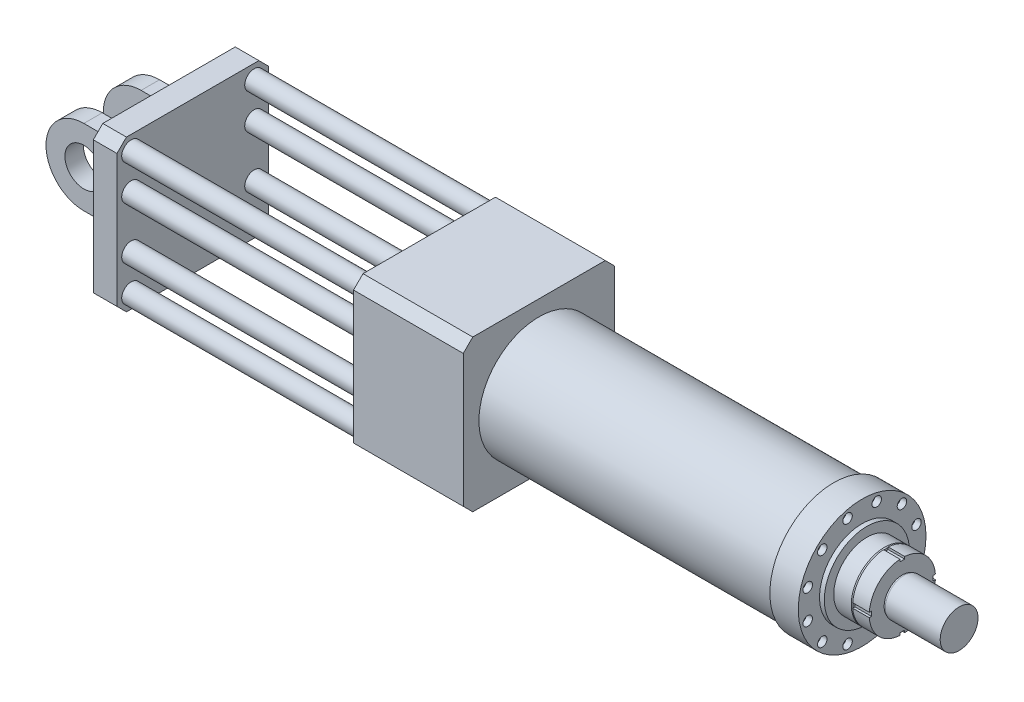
from build123d import *

# Parameters (mm, degrees)
SKETCH_1_R                = 127
SKETCH_1_R_2              = 110
EXTRUDE_1_DEPTH           = 623
SKETCH_2_R                = 135
SKETCH_2_R_2              = 6.5
EXTRUDE_2_DEPTH           = 60
SKETCH_3_R                = 90
EXTRUDE_3_DEPTH           = 10
SKETCH_5_R                = 70
EXTRUDE_4_DEPTH           = 40
CHAMFER_1_SIZE            = 3
CHAMFER_1_SIZE2           = 1.091910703
SKETCH_7_R                = 70
EXTRUDE_5_DEPTH           = 35
SKETCH_8_R                = 38.5
EXTRUDE_6_DEPTH           = 4
SKETCH_9_R                = 40
EXTRUDE_7_DEPTH           = 116
SKETCH_10_W               = 10
SKETCH_10_H               = 12.219318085
SKETCH_10_W_2             = 33.965202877
SKETCH_10_H_2             = 10
SKETCH_10_H_3             = 35.687535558
CUT_EXTRUDE_2_DEPTH       = 35
SKETCH_11_R               = 130
EXTRUDE_8_DEPTH           = 162
SKETCH_15_W               = 320
SKETCH_15_H               = 320
EXTRUDE_10_DEPTH          = 70
SKETCH_16_R               = 80
CUT_EXTRUDE_4_DEPTH       = 26
SKETCH_17_R               = 81.5
CUT_EXTRUDE_5_DEPTH       = 38
EXTRUDE_START             = 500
SKETCH_18_W               = 320
SKETCH_18_H               = 320
EXTRUDE_11_DEPTH          = 50
SKETCH_19_R               = 20
EXTRUDE_12_DEPTH          = 500
SKETCH_22_W               = 10
SKETCH_22_H               = 13
HOLE_WIZARD_1_AT_2_COUNT  = 2
HOLE_WIZARD_1_AT_2_PITCH  = 61.598932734
HOLE_WIZARD_1_AT_3_COUNT  = 2
HOLE_WIZARD_1_AT_3_PITCH  = 119
HOLE_WIZARD_1_AT_4_COUNT  = 2
HOLE_WIZARD_1_AT_4_PITCH  = 168.291413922
HOLE_WIZARD_1_AT_5_COUNT  = 2
HOLE_WIZARD_1_AT_5_PITCH  = 206.114046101
HOLE_WIZARD_1_AT_6_COUNT  = 2
HOLE_WIZARD_1_AT_6_PITCH  = 229.890346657
HOLE_WIZARD_1_AT_7_COUNT  = 2
HOLE_WIZARD_1_AT_7_PITCH  = 238
HOLE_WIZARD_1_AT_8_COUNT  = 2
HOLE_WIZARD_1_AT_8_PITCH  = 229.890346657
HOLE_WIZARD_1_AT_9_COUNT  = 2
HOLE_WIZARD_1_AT_9_PITCH  = 206.114046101
HOLE_WIZARD_1_AT_10_COUNT = 2
HOLE_WIZARD_1_AT_10_PITCH = 168.291413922
HOLE_WIZARD_1_AT_11_COUNT = 2
HOLE_WIZARD_1_AT_11_PITCH = 119
HOLE_WIZARD_1_AT_12_COUNT = 2
HOLE_WIZARD_1_AT_12_PITCH = 61.598932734
SKETCH_23_W               = 39
SKETCH_23_H               = 160
EXTRUDE_13_DEPTH          = 180
SKETCH_24_R               = 40
CUT_EXTRUDE_6_DEPTH       = 180
CHAMFER_2_SIZE            = 20
CHAMFER_3_SIZE            = 10
CHAMFER_4_SIZE            = 20
EXTRUDE_14_DEPTH          = 162


with BuildPart() as part:
    # Sketch 1 → Extrude 1 (new body)
    with BuildSketch(Plane(origin=(0, 0, 0), x_dir=(0, 0, -1), z_dir=(1, 0, 0))):
        Circle(SKETCH_1_R)
        Circle(SKETCH_1_R_2, mode=Mode.SUBTRACT)
    extrude(amount=EXTRUDE_1_DEPTH)



with BuildPart() as body_2:
    # Sketch 2 → Extrude 2 (new body)
    with BuildSketch(Plane(origin=(623, 0, 0), x_dir=(0, 0, -1), z_dir=(1, 0, 0))):
        Circle(SKETCH_2_R)
        with Locations((30.799466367, 114.945173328)):
            Circle(SKETCH_2_R_2, mode=Mode.SUBTRACT)
        with Locations((84.145706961, 84.145706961)):
            Circle(SKETCH_2_R_2, mode=Mode.SUBTRACT)
        with Locations((114.945173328, 30.799466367)):
            Circle(SKETCH_2_R_2, mode=Mode.SUBTRACT)
        with Locations((114.945173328, -30.799466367)):
            Circle(SKETCH_2_R_2, mode=Mode.SUBTRACT)
        with Locations((84.145706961, -84.145706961)):
            Circle(SKETCH_2_R_2, mode=Mode.SUBTRACT)
        with Locations((30.799466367, -114.945173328)):
            Circle(SKETCH_2_R_2, mode=Mode.SUBTRACT)
        with Locations((-30.799466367, -114.945173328)):
            Circle(SKETCH_2_R_2, mode=Mode.SUBTRACT)
        with Locations((-84.145706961, -84.145706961)):
            Circle(SKETCH_2_R_2, mode=Mode.SUBTRACT)
        with Locations((-114.945173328, -30.799466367)):
            Circle(SKETCH_2_R_2, mode=Mode.SUBTRACT)
        with Locations((-114.945173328, 30.799466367)):
            Circle(SKETCH_2_R_2, mode=Mode.SUBTRACT)
        with Locations((-84.145706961, 84.145706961)):
            Circle(SKETCH_2_R_2, mode=Mode.SUBTRACT)
        with Locations((-30.799466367, 114.945173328)):
            Circle(SKETCH_2_R_2, mode=Mode.SUBTRACT)
    extrude(amount=EXTRUDE_2_DEPTH)

    # Sketch 3 → Extrude 3 (add)
    with BuildSketch(Plane(origin=(683, 0, 0), x_dir=(0, 0, -1), z_dir=(1, 0, 0))):
        Circle(SKETCH_3_R)
    extrude(amount=EXTRUDE_3_DEPTH)

    # Sketch 5 → Extrude 4 (add)
    with BuildSketch(Plane(origin=(693, 0, 0), x_dir=(0, 0, -1), z_dir=(1, 0, 0))):
        Circle(SKETCH_5_R)
    extrude(amount=EXTRUDE_4_DEPTH)

    # Chamfer 1
    chamfer_1_edges = [body_2.edges().sort_by_distance(p)[0] for p in [
        (733, 0, 70),
    ]]
    chamfer_1_side = [body_2.faces().sort_by_distance(p)[0] for p in [
        (713, 0, 70),
    ]]
    chamfer(chamfer_1_edges, length=CHAMFER_1_SIZE, length2=CHAMFER_1_SIZE2, reference=chamfer_1_side[0])

    # Sketch 7 → Extrude 5 (add)
    with BuildSketch(Plane(origin=(733, 0, 0), x_dir=(0, 0, -1), z_dir=(1, 0, 0))):
        Circle(SKETCH_7_R)
    extrude(amount=EXTRUDE_5_DEPTH)

    # Sketch 8 → Extrude 6 (add)
    with BuildSketch(Plane(origin=(768, 0, 0), x_dir=(0, 0, -1), z_dir=(1, 0, 0))):
        Circle(SKETCH_8_R)
    extrude(amount=EXTRUDE_6_DEPTH)

    # Sketch 9 → Extrude 7 (add)
    with BuildSketch(Plane(origin=(772, 0, 0), x_dir=(0, 0, -1), z_dir=(1, 0, 0))):
        with Locations(Location((0, 0, 0), (0, 0, 180))):
            Circle(SKETCH_9_R)
    extrude(amount=EXTRUDE_7_DEPTH)

    # Sketch 10 → Cut-Extrude 2 (cut)
    with BuildSketch(Plane(origin=(768, 0, 0), x_dir=(0, 0, -1), z_dir=(1, 0, 0))):
        with Locations((0, -71.109659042)):
            Rectangle(SKETCH_10_W, SKETCH_10_H)
        Polygon((-76.465931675, 5), (-65, 5), (-65, -5), (-79.460488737, -5), align=None)
        with Locations((81.982601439, 0)):
            Rectangle(SKETCH_10_W_2, SKETCH_10_H_2)
        with Locations((0, 82.843767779)):
            Rectangle(SKETCH_10_W, SKETCH_10_H_3)
    extrude(amount=-CUT_EXTRUDE_2_DEPTH, mode=Mode.SUBTRACT)

    # Sketch 22 → Hole Wizard 1 (revolve, cut)
    with BuildSketch(Plane(origin=(683, 84.145706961, 84.145706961), x_dir=(0, 0, -1), z_dir=(0, 1, 0))):
        with Locations((5, 6.5)):
            Rectangle(SKETCH_22_W, SKETCH_22_H)
    hole_wizard_1 = revolve(axis=Axis((573, 84.145706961, 84.145706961), (1, 0, 0)), mode=Mode.SUBTRACT)

    # Hole Wizard 1 at 2: Hole Wizard 1 ×2
    with Locations(*[Vector(0, 0.5000000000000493, -0.8660254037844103) * (i * HOLE_WIZARD_1_AT_2_PITCH) for i in range(1, HOLE_WIZARD_1_AT_2_COUNT)]):
        add(hole_wizard_1, mode=Mode.SUBTRACT)

    # Hole Wizard 1 at 3: Hole Wizard 1 ×2
    with Locations(*[Vector(0, 0.2588190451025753, -0.9659258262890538) * (i * HOLE_WIZARD_1_AT_3_PITCH) for i in range(1, HOLE_WIZARD_1_AT_3_COUNT)]):
        add(hole_wizard_1, mode=Mode.SUBTRACT)

    # Hole Wizard 1 at 4: Hole Wizard 1 ×2
    with Locations(*[(0, 0, -i * HOLE_WIZARD_1_AT_4_PITCH) for i in range(1, HOLE_WIZARD_1_AT_4_COUNT)]):
        add(hole_wizard_1, mode=Mode.SUBTRACT)

    # Hole Wizard 1 at 5: Hole Wizard 1 ×2
    with Locations(*[Vector(0, -0.2588190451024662, -0.965925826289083) * (i * HOLE_WIZARD_1_AT_5_PITCH) for i in range(1, HOLE_WIZARD_1_AT_5_COUNT)]):
        add(hole_wizard_1, mode=Mode.SUBTRACT)

    # Hole Wizard 1 at 6: Hole Wizard 1 ×2
    with Locations(*[Vector(0, -0.49999999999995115, -0.8660254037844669) * (i * HOLE_WIZARD_1_AT_6_PITCH) for i in range(1, HOLE_WIZARD_1_AT_6_COUNT)]):
        add(hole_wizard_1, mode=Mode.SUBTRACT)

    # Hole Wizard 1 at 7: Hole Wizard 1 ×2
    with Locations(*[Vector(0, -0.7071067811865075, -0.7071067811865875) * (i * HOLE_WIZARD_1_AT_7_PITCH) for i in range(1, HOLE_WIZARD_1_AT_7_COUNT)]):
        add(hole_wizard_1, mode=Mode.SUBTRACT)

    # Hole Wizard 1 at 8: Hole Wizard 1 ×2
    with Locations(*[Vector(0, -0.8660254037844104, -0.5000000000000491) * (i * HOLE_WIZARD_1_AT_8_PITCH) for i in range(1, HOLE_WIZARD_1_AT_8_COUNT)]):
        add(hole_wizard_1, mode=Mode.SUBTRACT)

    # Hole Wizard 1 at 9: Hole Wizard 1 ×2
    with Locations(*[Vector(0, -0.9659258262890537, -0.2588190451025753) * (i * HOLE_WIZARD_1_AT_9_PITCH) for i in range(1, HOLE_WIZARD_1_AT_9_COUNT)]):
        add(hole_wizard_1, mode=Mode.SUBTRACT)

    # Hole Wizard 1 at 10: Hole Wizard 1 ×2
    with Locations(*[(0, -i * HOLE_WIZARD_1_AT_10_PITCH, 0) for i in range(1, HOLE_WIZARD_1_AT_10_COUNT)]):
        add(hole_wizard_1, mode=Mode.SUBTRACT)

    # Hole Wizard 1 at 11: Hole Wizard 1 ×2
    with Locations(*[Vector(0, -0.9659258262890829, 0.2588190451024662) * (i * HOLE_WIZARD_1_AT_11_PITCH) for i in range(1, HOLE_WIZARD_1_AT_11_COUNT)]):
        add(hole_wizard_1, mode=Mode.SUBTRACT)

    # Hole Wizard 1 at 12: Hole Wizard 1 ×2
    with Locations(*[Vector(0, -0.8660254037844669, 0.4999999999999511) * (i * HOLE_WIZARD_1_AT_12_PITCH) for i in range(1, HOLE_WIZARD_1_AT_12_COUNT)]):
        add(hole_wizard_1, mode=Mode.SUBTRACT)


with BuildPart() as body_3:
    # Sketch 11 → Extrude 8 (new body)
    with BuildSketch(Plane.ZY):
        Circle(SKETCH_11_R)
    extrude(amount=EXTRUDE_8_DEPTH)


with BuildPart() as body_4:
    # Sketch 15 → Extrude 10 (new body)
    with BuildSketch(Plane.ZY.offset(162)):
        Rectangle(SKETCH_15_W, SKETCH_15_H)
    extrude(amount=EXTRUDE_10_DEPTH)

    # Sketch 16 → Cut-Extrude 4 (cut)
    with BuildSketch(Plane.ZY.offset(232)):
        Circle(SKETCH_16_R)
    extrude(amount=-CUT_EXTRUDE_4_DEPTH, mode=Mode.SUBTRACT)

    # Sketch 17 → Cut-Extrude 5 (cut)
    with BuildSketch(Plane.ZY.offset(206)):
        Circle(SKETCH_17_R)
    extrude(amount=-CUT_EXTRUDE_5_DEPTH, mode=Mode.SUBTRACT)

    # Sketch 19 → Extrude 12 (add)
    with BuildSketch(Plane.ZY.offset(232)):
        with Locations((130, 130)):
            Circle(SKETCH_19_R)
        with Locations((130, -130)):
            Circle(SKETCH_19_R)
        with Locations(Location((-130, -130, 0), (0, 0, 180))):
            Circle(SKETCH_19_R)
        with Locations(Location((-130, 130, 0), (0, 0, 180))):
            Circle(SKETCH_19_R)
        with Locations((-130, 55)):
            Circle(SKETCH_19_R)
        with Locations((-130, -55)):
            Circle(SKETCH_19_R)
        with Locations((130, 55)):
            Circle(SKETCH_19_R)
        with Locations((130, -55)):
            Circle(SKETCH_19_R)
    extrude(amount=EXTRUDE_12_DEPTH)

    # Chamfer 2
    chamfer_2_edges = [body_4.edges().sort_by_distance(p)[0] for p in [
        (-197, -160, 160),
        (-197, -160, -160),
        (-197, 160, -160),
        (-197, 160, 160),
    ]]
    chamfer(chamfer_2_edges, length=CHAMFER_2_SIZE)


with BuildPart() as body_5:
    # Sketch 18 → Extrude 11 (new body)
    with BuildSketch(Plane.ZY.offset(232).offset(EXTRUDE_START)):
        Rectangle(SKETCH_18_W, SKETCH_18_H)
    extrude(amount=EXTRUDE_11_DEPTH)

    # Sketch 23 → Extrude 13 (add)
    with BuildSketch(Plane.ZY.offset(782)):
        with Locations((-60.5, 0)):
            Rectangle(SKETCH_23_W, SKETCH_23_H)
        with Locations((60.5, 0)):
            Rectangle(SKETCH_23_W, SKETCH_23_H)
    extrude(amount=EXTRUDE_13_DEPTH)

    # Sketch 24 → Cut-Extrude 6 (cut)
    with BuildSketch(Plane.XY.offset(80)):
        with Locations((-882, 0)):
            Circle(SKETCH_24_R)
        with BuildLine():
            Line((-882, 80), (-1066.45371507, 143.032965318))
            Line((-1066.45371507, 143.032965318), (-1039.599590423, -152.430180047))
            Line((-1039.599590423, -152.430180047), (-882, -80))
            ThreePointArc((-882, -80), (-962, 0), (-882, 80))
        make_face()
    extrude(amount=-CUT_EXTRUDE_6_DEPTH, mode=Mode.SUBTRACT)

    # Chamfer 3
    chamfer_3_edges = [body_5.edges().sort_by_distance(p)[0] for p in [
        (-782, 0, -41),
        (-782, 80, -60.5),
        (-782, 0, -80),
        (-782, -80, -60.5),
        (-782, 0, 80),
        (-782, 80, 60.5),
        (-782, 0, 41),
        (-782, -80, 60.5),
    ]]
    chamfer(chamfer_3_edges, length=CHAMFER_3_SIZE)

    # Chamfer 4
    chamfer_4_edges = [body_5.edges().sort_by_distance(p)[0] for p in [
        (-757, -160, 160),
        (-757, -160, -160),
        (-757, 160, -160),
        (-757, 160, 160),
    ]]
    chamfer(chamfer_4_edges, length=CHAMFER_4_SIZE)


with BuildPart() as part_1:
    add(part.part)

    add(body_3.part)  # Extrude 14 merges body 3

    add(body_4.part)  # Extrude 14 merges body 4
    # Sketch 25 → Extrude 14 (add)
    with BuildSketch(Plane(origin=(-162, 0, 0), x_dir=(0, 0, -1), z_dir=(1, 0, 0))):
        Polygon((160, 140), (140, 160), (-140, 160), (-160, 140), (-160, -140), (-140, -160), (140, -160), (160, -140), align=None)
    extrude(amount=EXTRUDE_14_DEPTH)


solid = Compound([body_2.part, body_5.part, part_1.part])
